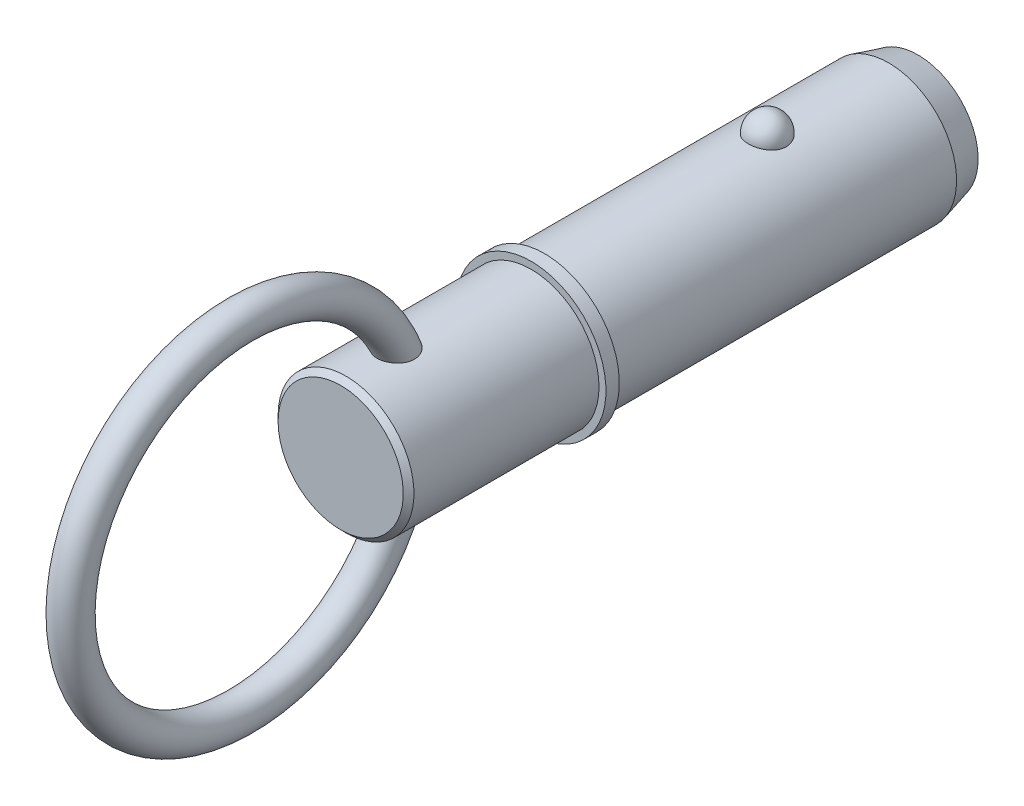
ISO-10303-21;
HEADER;
FILE_DESCRIPTION(('STEP AP214'),'2;1');
FILE_NAME('part.step','',(''),(''),'','','');
FILE_SCHEMA(('AUTOMOTIVE_DESIGN { 1 0 10303 214 1 1 1 1 }'));
ENDSEC;
DATA;
#1=APPLICATION_CONTEXT('core data for automotive mechanical design processes');
#2=APPLICATION_PROTOCOL_DEFINITION('international standard','automotive_design',2000,#1);
#3=PRODUCT_CONTEXT('',#1,'mechanical');
#4=PRODUCT('Part','Part','',(#3));
#5=PRODUCT_RELATED_PRODUCT_CATEGORY('part','',(#4));
#6=PRODUCT_DEFINITION_FORMATION('','',#4);
#7=PRODUCT_DEFINITION_CONTEXT('part definition',#1,'design');
#8=PRODUCT_DEFINITION('design','',#6,#7);
#9=PRODUCT_DEFINITION_SHAPE('','',#8);
#10=(LENGTH_UNIT() NAMED_UNIT(*) SI_UNIT(.MILLI.,.METRE.));
#11=(NAMED_UNIT(*) PLANE_ANGLE_UNIT() SI_UNIT($,.RADIAN.));
#12=(NAMED_UNIT(*) SI_UNIT($,.STERADIAN.) SOLID_ANGLE_UNIT());
#13=UNCERTAINTY_MEASURE_WITH_UNIT(LENGTH_MEASURE(1.E-05),#10,'distance_accuracy_value','');
#14=(GEOMETRIC_REPRESENTATION_CONTEXT(3) GLOBAL_UNCERTAINTY_ASSIGNED_CONTEXT((#13)) GLOBAL_UNIT_ASSIGNED_CONTEXT((#10,
#11,#12)) REPRESENTATION_CONTEXT('',''));
#15=CARTESIAN_POINT('',(0.,0.,0.));
#16=DIRECTION('',(0.,0.,1.));
#17=DIRECTION('',(1.,0.,0.));
#18=AXIS2_PLACEMENT_3D('',#15,#16,#17);
#19=CARTESIAN_POINT('',(0.,0.,38.1));
#20=DIRECTION('',(0.,0.,-1.));
#21=DIRECTION('',(-1.,0.,0.));
#22=AXIS2_PLACEMENT_3D('',#19,#20,#21);
#23=CYLINDRICAL_SURFACE('',#22,12.7);
#24=CARTESIAN_POINT('',(3.52486003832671,12.2010393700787,-3.56));
#25=CARTESIAN_POINT('',(3.52485671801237,12.2010422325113,-3.3610062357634));
#26=CARTESIAN_POINT('',(3.50863187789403,12.2057632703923,-3.16197042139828));
#27=CARTESIAN_POINT('',(3.4441205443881,12.2241207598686,-2.76953945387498));
#28=CARTESIAN_POINT('',(3.39582213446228,12.2377605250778,-2.57614642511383));
#29=CARTESIAN_POINT('',(3.26839193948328,12.2724057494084,-2.20059799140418));
#30=CARTESIAN_POINT('',(3.18927369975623,12.2934079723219,-2.01843769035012));
#31=CARTESIAN_POINT('',(3.00217139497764,12.3404306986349,-1.6703228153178));
#32=CARTESIAN_POINT('',(2.89418796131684,12.3664510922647,-1.50436788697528));
#33=CARTESIAN_POINT('',(2.65144862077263,12.4207616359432,-1.19241975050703));
#34=CARTESIAN_POINT('',(2.51656310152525,12.4490623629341,-1.04652919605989));
#35=CARTESIAN_POINT('',(2.22383249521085,12.5046678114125,-0.779711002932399));
#36=CARTESIAN_POINT('',(2.0659873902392,12.5319725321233,-0.658783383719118));
#37=CARTESIAN_POINT('',(1.73204520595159,12.5824645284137,-0.445586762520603));
#38=CARTESIAN_POINT('',(1.55600183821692,12.6056634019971,-0.353236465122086));
#39=CARTESIAN_POINT('',(1.19021695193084,12.6454411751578,-0.199381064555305));
#40=CARTESIAN_POINT('',(1.00047694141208,12.662020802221,-0.137872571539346));
#41=CARTESIAN_POINT('',(0.616329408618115,12.6864692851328,-0.0483191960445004));
#42=CARTESIAN_POINT('',(0.422067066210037,12.6944893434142,-0.0196927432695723));
#43=CARTESIAN_POINT('',(0.0313259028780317,12.7014637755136,0.00524116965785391));
#44=CARTESIAN_POINT('',(-0.16515270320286,12.7004190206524,0.0015517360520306));
#45=CARTESIAN_POINT('',(-0.55178088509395,12.6894611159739,-0.0377454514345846));
#46=CARTESIAN_POINT('',(-0.741980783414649,12.6796749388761,-0.0728962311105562));
#47=CARTESIAN_POINT('',(-1.11361063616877,12.6524544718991,-0.173489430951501));
#48=CARTESIAN_POINT('',(-1.29504043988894,12.6350200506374,-0.238932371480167));
#49=CARTESIAN_POINT('',(-1.64521311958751,12.5942270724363,-0.398772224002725));
#50=CARTESIAN_POINT('',(-1.81387645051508,12.5708347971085,-0.493334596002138));
#51=CARTESIAN_POINT('',(-2.13292959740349,12.5206522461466,-0.708731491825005));
#52=CARTESIAN_POINT('',(-2.28331755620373,12.4938616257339,-0.829568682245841));
#53=CARTESIAN_POINT('',(-2.56470285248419,12.4391828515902,-1.0968714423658));
#54=CARTESIAN_POINT('',(-2.69527522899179,12.4112835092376,-1.24378221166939));
#55=CARTESIAN_POINT('',(-2.93023079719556,12.3579248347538,-1.55763192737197));
#56=CARTESIAN_POINT('',(-3.03461212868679,12.3324656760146,-1.72457229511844));
#57=CARTESIAN_POINT('',(-3.21564423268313,12.2865167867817,-2.07598316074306));
#58=CARTESIAN_POINT('',(-3.29196222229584,12.2660875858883,-2.26063321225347));
#59=CARTESIAN_POINT('',(-3.41323771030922,12.2328979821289,-2.64061334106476));
#60=CARTESIAN_POINT('',(-3.45819611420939,12.2201373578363,-2.83594310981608));
#61=CARTESIAN_POINT('',(-3.51550038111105,12.2037762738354,-3.2308649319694));
#62=CARTESIAN_POINT('',(-3.5279827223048,12.200137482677,-3.43043558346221));
#63=CARTESIAN_POINT('',(-3.52041430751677,12.2023234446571,-3.8289025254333));
#64=CARTESIAN_POINT('',(-3.50036443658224,12.2081479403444,-4.02779883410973));
#65=CARTESIAN_POINT('',(-3.42842010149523,12.2285446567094,-4.41824213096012));
#66=CARTESIAN_POINT('',(-3.37668525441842,12.243073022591,-4.6098208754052));
#67=CARTESIAN_POINT('',(-3.24279085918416,12.2792134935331,-4.98132360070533));
#68=CARTESIAN_POINT('',(-3.16063009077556,12.300825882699,-5.16124711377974));
#69=CARTESIAN_POINT('',(-2.96738224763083,12.3488691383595,-5.5054285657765));
#70=CARTESIAN_POINT('',(-2.85613997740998,12.3753256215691,-5.66959579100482));
#71=CARTESIAN_POINT('',(-2.60773241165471,12.4300386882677,-5.97665065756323));
#72=CARTESIAN_POINT('',(-2.47056612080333,12.458295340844,-6.11953748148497));
#73=CARTESIAN_POINT('',(-2.17327999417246,12.5135827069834,-6.38059312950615));
#74=CARTESIAN_POINT('',(-2.01307652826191,12.5406084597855,-6.49866785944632));
#75=CARTESIAN_POINT('',(-1.67442544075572,12.5902954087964,-6.70609314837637));
#76=CARTESIAN_POINT('',(-1.49597909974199,12.6129569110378,-6.79544572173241));
#77=CARTESIAN_POINT('',(-1.12819666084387,12.6511224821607,-6.94192787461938));
#78=CARTESIAN_POINT('',(-0.939024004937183,12.666712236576,-6.99944518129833));
#79=CARTESIAN_POINT('',(-0.553267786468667,12.6894125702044,-7.08227444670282));
#80=CARTESIAN_POINT('',(-0.356685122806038,12.6965241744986,-7.10759029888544));
#81=CARTESIAN_POINT('',(0.0343320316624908,12.7014305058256,-7.12510946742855));
#82=CARTESIAN_POINT('',(0.228736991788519,12.6993986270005,-7.11792901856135));
#83=CARTESIAN_POINT('',(0.613493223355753,12.6866339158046,-7.07206766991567));
#84=CARTESIAN_POINT('',(0.80384464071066,12.6759013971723,-7.03338790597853));
#85=CARTESIAN_POINT('',(1.17440741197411,12.6469443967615,-6.925834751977));
#86=CARTESIAN_POINT('',(1.35465462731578,12.6287486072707,-6.85707692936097));
#87=CARTESIAN_POINT('',(1.70092526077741,12.5867908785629,-6.69128257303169));
#88=CARTESIAN_POINT('',(1.86694777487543,12.5630285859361,-6.59424424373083));
#89=CARTESIAN_POINT('',(2.18289085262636,12.5120350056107,-6.3727748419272));
#90=CARTESIAN_POINT('',(2.33252391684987,12.4847559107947,-6.24794475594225));
#91=CARTESIAN_POINT('',(2.60889724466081,12.4299457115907,-5.97511730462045));
#92=CARTESIAN_POINT('',(2.73563353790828,12.4024145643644,-5.82711592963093));
#93=CARTESIAN_POINT('',(2.96505559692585,12.3495984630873,-5.50912267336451));
#94=CARTESIAN_POINT('',(3.06728335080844,12.3243610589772,-5.33879227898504));
#95=CARTESIAN_POINT('',(3.24218794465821,12.2795120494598,-4.98295005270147));
#96=CARTESIAN_POINT('',(3.31487538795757,12.2598984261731,-4.79744369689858));
#97=CARTESIAN_POINT('',(3.42255689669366,12.2302435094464,-4.43775244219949));
#98=CARTESIAN_POINT('',(3.46085292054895,12.2193780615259,-4.264615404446));
#99=CARTESIAN_POINT('',(3.5120056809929,12.2047747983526,-3.9143299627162));
#100=CARTESIAN_POINT('',(3.52486299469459,12.2010368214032,-3.73718164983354));
#101=CARTESIAN_POINT('',(3.52486003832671,12.2010393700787,-3.56));
#102=B_SPLINE_CURVE_WITH_KNOTS('',3,(#24,#25,#26,#27,#28,#29,#30,#31,#32,#33,#34,#35,#36,#37,
#38,#39,#40,#41,#42,#43,#44,#45,#46,#47,#48,#49,#50,#51,#52,#53,#54,#55,#56,#57,#58,#59,#60,#61,
#62,#63,#64,#65,#66,#67,#68,#69,#70,#71,#72,#73,#74,#75,#76,#77,#78,#79,#80,#81,#82,#83,#84,#85,
#86,#87,#88,#89,#90,#91,#92,#93,#94,#95,#96,#97,#98,#99,#100,#101),.UNSPECIFIED.,.T.,.F.,(4,2,2,
2,2,2,2,2,2,2,2,2,2,2,2,2,2,2,2,2,2,2,2,2,2,2,2,2,2,2,2,2,2,2,2,2,2,2,4),(0.,0.596344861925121,
1.19291141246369,1.78921606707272,2.38550767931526,2.98474477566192,3.58398233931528,
4.18149920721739,4.77895038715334,5.36566361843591,5.95232045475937,6.53059198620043,
7.10887345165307,7.6905033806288,8.27219236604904,8.86498552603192,9.45782077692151,
10.0574751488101,10.6571122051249,11.2542252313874,11.8513220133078,12.4454353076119,
13.0395724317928,13.636947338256,14.2343451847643,14.8339691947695,15.4335511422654,
16.0256602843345,16.6176978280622,17.1985559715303,17.7793931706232,18.3580179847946,
18.9366795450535,19.5242567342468,20.1119357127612,20.7098642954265,21.3075780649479,
21.8385683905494,22.3695466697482),.UNSPECIFIED.);
#103=CARTESIAN_POINT('',(3.52486003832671,12.2010393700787,-3.56));
#104=VERTEX_POINT('',#103);
#105=EDGE_CURVE('E102',#104,#104,#102,.T.);
#106=ORIENTED_EDGE('',*,*,#105,.T.);
#107=EDGE_LOOP('',(#106));
#108=FACE_BOUND('',#107,.T.);
#109=CARTESIAN_POINT('',(0.,0.,-26.2500000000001));
#110=DIRECTION('',(0.,0.,-1.));
#111=DIRECTION('',(-1.,0.,0.));
#112=AXIS2_PLACEMENT_3D('',#109,#110,#111);
#113=CIRCLE('',#112,12.7);
#114=CARTESIAN_POINT('',(-12.7,0.,-26.2500000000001));
#115=VERTEX_POINT('',#114);
#116=EDGE_CURVE('E110',#115,#115,#113,.F.);
#117=ORIENTED_EDGE('',*,*,#116,.T.);
#118=EDGE_LOOP('',(#117));
#119=FACE_BOUND('',#118,.T.);
#120=CARTESIAN_POINT('',(0.,0.,38.1));
#121=DIRECTION('',(0.,0.,1.));
#122=DIRECTION('',(1.,0.,0.));
#123=AXIS2_PLACEMENT_3D('',#120,#121,#122);
#124=CIRCLE('',#123,12.7);
#125=CARTESIAN_POINT('',(12.7,0.,38.1));
#126=VERTEX_POINT('',#125);
#127=EDGE_CURVE('E108',#126,#126,#124,.T.);
#128=ORIENTED_EDGE('',*,*,#127,.F.);
#129=EDGE_LOOP('',(#128));
#130=FACE_BOUND('',#129,.T.);
#131=ADVANCED_FACE('F39',(#108,#119,#130),#23,.T.);
#132=CARTESIAN_POINT('',(0.,0.,-31.75));
#133=DIRECTION('',(0.,0.,-1.));
#134=DIRECTION('',(-1.,0.,0.));
#135=AXIS2_PLACEMENT_3D('',#132,#133,#134);
#136=PLANE('',#135);
#137=CARTESIAN_POINT('',(0.,0.,-31.75));
#138=DIRECTION('',(0.,0.,-1.));
#139=DIRECTION('',(-1.,0.,0.));
#140=AXIS2_PLACEMENT_3D('',#137,#138,#139);
#141=CIRCLE('',#140,11.2262794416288);
#142=CARTESIAN_POINT('',(-11.2262794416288,0.,-31.75));
#143=VERTEX_POINT('',#142);
#144=EDGE_CURVE('E143',#143,#143,#141,.T.);
#145=ORIENTED_EDGE('',*,*,#144,.T.);
#146=EDGE_LOOP('',(#145));
#147=FACE_BOUND('',#146,.T.);
#148=ADVANCED_FACE('F88',(#147),#136,.T.);
#149=CARTESIAN_POINT('',(0.,0.,-31.75));
#150=DIRECTION('',(0.,0.,1.));
#151=DIRECTION('',(1.,0.,0.));
#152=AXIS2_PLACEMENT_3D('',#149,#150,#151);
#153=CONICAL_SURFACE('',#152,11.2262794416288,0.26179938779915);
#154=ORIENTED_EDGE('',*,*,#116,.F.);
#155=EDGE_LOOP('',(#154));
#156=FACE_BOUND('',#155,.T.);
#157=ORIENTED_EDGE('',*,*,#144,.F.);
#158=EDGE_LOOP('',(#157));
#159=FACE_BOUND('',#158,.T.);
#160=ADVANCED_FACE('F94',(#156,#159),#153,.T.);
#161=CARTESIAN_POINT('',(0.,12.7,-3.56));
#162=DIRECTION('',(0.,1.,0.));
#163=DIRECTION('',(0.,0.,1.));
#164=AXIS2_PLACEMENT_3D('',#161,#162,#163);
#165=SPHERICAL_SURFACE('',#164,3.56);
#166=ORIENTED_EDGE('',*,*,#105,.F.);
#167=EDGE_LOOP('',(#166));
#168=FACE_BOUND('',#167,.T.);
#169=ADVANCED_FACE('F113',(#168),#165,.T.);
#170=CARTESIAN_POINT('',(0.,0.,38.1));
#171=DIRECTION('',(0.,0.,-1.));
#172=DIRECTION('',(-1.,0.,0.));
#173=AXIS2_PLACEMENT_3D('',#170,#171,#172);
#174=PLANE('',#173);
#175=ORIENTED_EDGE('',*,*,#127,.T.);
#176=EDGE_LOOP('',(#175));
#177=FACE_BOUND('',#176,.T.);
#178=CARTESIAN_POINT('',(0.,0.,38.1));
#179=DIRECTION('',(0.,0.,-1.));
#180=DIRECTION('',(-1.,0.,0.));
#181=AXIS2_PLACEMENT_3D('',#178,#179,#180);
#182=CIRCLE('',#181,14.);
#183=CARTESIAN_POINT('',(-14.,0.,38.1));
#184=VERTEX_POINT('',#183);
#185=EDGE_CURVE('E109',#184,#184,#182,.T.);
#186=ORIENTED_EDGE('',*,*,#185,.T.);
#187=EDGE_LOOP('',(#186));
#188=FACE_BOUND('',#187,.T.);
#189=ADVANCED_FACE('F117',(#177,#188),#174,.T.);
#190=CARTESIAN_POINT('',(0.,0.,33.7287874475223));
#191=DIRECTION('',(0.,0.,-1.));
#192=DIRECTION('',(-1.,0.,0.));
#193=AXIS2_PLACEMENT_3D('',#190,#191,#192);
#194=CYLINDRICAL_SURFACE('',#193,14.);
#195=CARTESIAN_POINT('',(0.,0.,40.6));
#196=DIRECTION('',(0.,0.,-1.));
#197=DIRECTION('',(-1.,0.,0.));
#198=AXIS2_PLACEMENT_3D('',#195,#196,#197);
#199=CIRCLE('',#198,14.);
#200=CARTESIAN_POINT('',(-14.,0.,40.6));
#201=VERTEX_POINT('',#200);
#202=EDGE_CURVE('E134',#201,#201,#199,.T.);
#203=ORIENTED_EDGE('',*,*,#202,.T.);
#204=EDGE_LOOP('',(#203));
#205=FACE_BOUND('',#204,.T.);
#206=ORIENTED_EDGE('',*,*,#185,.F.);
#207=EDGE_LOOP('',(#206));
#208=FACE_BOUND('',#207,.T.);
#209=ADVANCED_FACE('F121',(#205,#208),#194,.T.);
#210=CARTESIAN_POINT('',(0.,14.,40.6));
#211=DIRECTION('',(0.,0.,1.));
#212=DIRECTION('',(1.,0.,0.));
#213=AXIS2_PLACEMENT_3D('',#210,#211,#212);
#214=PLANE('',#213);
#215=CARTESIAN_POINT('',(0.,0.,40.6));
#216=DIRECTION('',(0.,0.,1.));
#217=DIRECTION('',(1.,0.,0.));
#218=AXIS2_PLACEMENT_3D('',#215,#216,#217);
#219=CIRCLE('',#218,12.7);
#220=CARTESIAN_POINT('',(12.7,0.,40.6));
#221=VERTEX_POINT('',#220);
#222=EDGE_CURVE('E112',#221,#221,#219,.T.);
#223=ORIENTED_EDGE('',*,*,#222,.F.);
#224=EDGE_LOOP('',(#223));
#225=FACE_BOUND('',#224,.T.);
#226=ORIENTED_EDGE('',*,*,#202,.F.);
#227=EDGE_LOOP('',(#226));
#228=FACE_BOUND('',#227,.T.);
#229=ADVANCED_FACE('F85',(#225,#228),#214,.T.);
#230=CARTESIAN_POINT('',(0.,0.,76.2));
#231=DIRECTION('',(0.,0.,-1.));
#232=DIRECTION('',(-1.,0.,0.));
#233=AXIS2_PLACEMENT_3D('',#230,#231,#232);
#234=CYLINDRICAL_SURFACE('',#233,12.7);
#235=CARTESIAN_POINT('',(-1.22892607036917,-12.6404011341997,62.5711939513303));
#236=CARTESIAN_POINT('',(-1.0611992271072,-12.6567092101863,62.5040042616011));
#237=CARTESIAN_POINT('',(-0.88766380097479,-12.6701810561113,62.4507925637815));
#238=CARTESIAN_POINT('',(-0.533823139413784,-12.6900116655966,62.3734192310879));
#239=CARTESIAN_POINT('',(-0.353518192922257,-12.6963707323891,62.3492563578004));
#240=CARTESIAN_POINT('',(0.00871153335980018,-12.7012887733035,62.3305190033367));
#241=CARTESIAN_POINT('',(0.190636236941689,-12.699848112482,62.3359431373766));
#242=CARTESIAN_POINT('',(0.550971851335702,-12.6893231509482,62.3762551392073));
#243=CARTESIAN_POINT('',(0.729382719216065,-12.6802387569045,62.4111433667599));
#244=CARTESIAN_POINT('',(1.07771687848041,-12.6553960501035,62.5096598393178));
#245=CARTESIAN_POINT('',(1.24763507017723,-12.6396337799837,62.573305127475));
#246=CARTESIAN_POINT('',(1.57398922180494,-12.6031560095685,62.7278916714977));
#247=CARTESIAN_POINT('',(1.73042571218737,-12.5824407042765,62.8188318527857));
#248=CARTESIAN_POINT('',(2.02464767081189,-12.5384554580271,63.0253206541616));
#249=CARTESIAN_POINT('',(2.16251370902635,-12.5151974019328,63.1407569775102));
#250=CARTESIAN_POINT('',(2.41652917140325,-12.4686447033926,63.3934261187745));
#251=CARTESIAN_POINT('',(2.53268123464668,-12.4453500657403,63.530656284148));
#252=CARTESIAN_POINT('',(2.7397169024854,-12.4014166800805,63.8222617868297));
#253=CARTESIAN_POINT('',(2.83072997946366,-12.3807646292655,63.9765433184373));
#254=CARTESIAN_POINT('',(2.98642630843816,-12.3441356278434,64.298338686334));
#255=CARTESIAN_POINT('',(3.05110876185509,-12.3281588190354,64.4658529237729));
#256=CARTESIAN_POINT('',(3.1545033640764,-12.3021148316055,64.8127059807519));
#257=CARTESIAN_POINT('',(3.19268116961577,-12.2921697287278,64.9922122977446));
#258=CARTESIAN_POINT('',(3.24150148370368,-12.2793848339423,65.3551447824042));
#259=CARTESIAN_POINT('',(3.25213515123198,-12.2765473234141,65.5385721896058));
#260=CARTESIAN_POINT('',(3.24696781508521,-12.2779158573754,65.9188932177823));
#261=CARTESIAN_POINT('',(3.22910261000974,-12.2826719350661,66.1157539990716));
#262=CARTESIAN_POINT('',(3.1650495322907,-12.2993299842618,66.5044791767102));
#263=CARTESIAN_POINT('',(3.11884966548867,-12.3112349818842,66.6963414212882));
#264=CARTESIAN_POINT('',(2.99323123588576,-12.3424162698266,67.0928913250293));
#265=CARTESIAN_POINT('',(2.91059577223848,-12.3623844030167,67.2965057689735));
#266=CARTESIAN_POINT('',(2.71447440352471,-12.4069229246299,67.6881909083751));
#267=CARTESIAN_POINT('',(2.60094970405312,-12.431499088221,67.8762416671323));
#268=CARTESIAN_POINT('',(2.40499526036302,-12.4703951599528,68.1474701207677));
#269=CARTESIAN_POINT('',(2.33301847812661,-12.4841083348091,68.2384072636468));
#270=CARTESIAN_POINT('',(2.18106597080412,-12.5115521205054,68.4133206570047));
#271=CARTESIAN_POINT('',(2.10108885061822,-12.5252827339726,68.4972956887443));
#272=CARTESIAN_POINT('',(1.8497396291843,-12.5657115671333,68.7367795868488));
#273=CARTESIAN_POINT('',(1.6664677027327,-12.5917488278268,68.8805264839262));
#274=CARTESIAN_POINT('',(1.33551340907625,-12.6303067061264,69.0858562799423));
#275=CARTESIAN_POINT('',(1.19512135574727,-12.6444898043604,69.1590224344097));
#276=CARTESIAN_POINT('',(0.903945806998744,-12.6686276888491,69.2815868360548));
#277=CARTESIAN_POINT('',(0.753173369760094,-12.6785868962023,69.3310099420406));
#278=CARTESIAN_POINT('',(0.444090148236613,-12.6931800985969,69.4029423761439));
#279=CARTESIAN_POINT('',(0.285741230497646,-12.6977833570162,69.4252963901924));
#280=CARTESIAN_POINT('',(-0.0324491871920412,-12.700953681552,69.4407247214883));
#281=CARTESIAN_POINT('',(-0.192290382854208,-12.6995219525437,69.4338048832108));
#282=CARTESIAN_POINT('',(-0.493822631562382,-12.6912132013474,69.3932090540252));
#283=CARTESIAN_POINT('',(-0.635865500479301,-12.6848307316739,69.3619622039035));
#284=CARTESIAN_POINT('',(-0.913041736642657,-12.6678986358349,69.2777216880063));
#285=CARTESIAN_POINT('',(-1.04817349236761,-12.6573480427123,69.2247229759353));
#286=CARTESIAN_POINT('',(-1.31637898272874,-12.6323524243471,69.0962339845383));
#287=CARTESIAN_POINT('',(-1.44890088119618,-12.6177203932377,69.0196381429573));
#288=CARTESIAN_POINT('',(-1.70162176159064,-12.5861326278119,68.8487430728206));
#289=CARTESIAN_POINT('',(-1.82181486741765,-12.569175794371,68.7544354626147));
#290=CARTESIAN_POINT('',(-2.06961284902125,-12.5309682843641,68.5326655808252));
#291=CARTESIAN_POINT('',(-2.19457628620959,-12.5094982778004,68.4022933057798));
#292=CARTESIAN_POINT('',(-2.42503767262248,-12.4668738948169,68.1253083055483));
#293=CARTESIAN_POINT('',(-2.53052086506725,-12.4457197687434,67.9786834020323));
#294=CARTESIAN_POINT('',(-2.73961150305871,-12.4015349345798,67.6430656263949));
#295=CARTESIAN_POINT('',(-2.83895917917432,-12.3789253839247,67.4513469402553));
#296=CARTESIAN_POINT('',(-3.00725804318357,-12.3391195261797,67.0544056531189));
#297=CARTESIAN_POINT('',(-3.07618857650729,-12.3219268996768,66.8491739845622));
#298=CARTESIAN_POINT('',(-3.18528660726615,-12.2942052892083,66.4137546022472));
#299=CARTESIAN_POINT('',(-3.22287145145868,-12.2842816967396,66.1828554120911));
#300=CARTESIAN_POINT('',(-3.24821271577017,-12.2775854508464,65.8343510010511));
#301=CARTESIAN_POINT('',(-3.25148236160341,-12.276719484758,65.7177778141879));
#302=CARTESIAN_POINT('',(-3.24729041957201,-12.2778310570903,65.4848590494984));
#303=CARTESIAN_POINT('',(-3.23983534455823,-12.2798068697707,65.368513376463));
#304=CARTESIAN_POINT('',(-3.21488959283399,-12.286359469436,65.1462276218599));
#305=CARTESIAN_POINT('',(-3.19823165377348,-12.2907201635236,65.0401869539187));
#306=CARTESIAN_POINT('',(-3.15537465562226,-12.3017926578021,64.8302225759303));
#307=CARTESIAN_POINT('',(-3.12918076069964,-12.3085031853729,64.7262977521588));
#308=CARTESIAN_POINT('',(-3.06721568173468,-12.3240904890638,64.5215537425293));
#309=CARTESIAN_POINT('',(-3.03144854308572,-12.3329663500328,64.4207332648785));
#310=CARTESIAN_POINT('',(-2.95042598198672,-12.3525998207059,64.2231715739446));
#311=CARTESIAN_POINT('',(-2.90517160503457,-12.3633572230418,64.1264299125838));
#312=CARTESIAN_POINT('',(-2.81116315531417,-12.3850478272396,63.9488579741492));
#313=CARTESIAN_POINT('',(-2.76340897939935,-12.3958187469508,63.8674768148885));
#314=CARTESIAN_POINT('',(-2.66091958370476,-12.4182228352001,63.7093176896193));
#315=CARTESIAN_POINT('',(-2.60618212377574,-12.4298562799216,63.6325412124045));
#316=CARTESIAN_POINT('',(-2.49013138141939,-12.4536239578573,63.4842781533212));
#317=CARTESIAN_POINT('',(-2.42882150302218,-12.4657579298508,63.4127888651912));
#318=CARTESIAN_POINT('',(-2.30002146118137,-12.4901640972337,63.2755874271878));
#319=CARTESIAN_POINT('',(-2.23252894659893,-12.5024363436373,63.2098774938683));
#320=CARTESIAN_POINT('',(-2.09370795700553,-12.5264205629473,63.0863775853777));
#321=CARTESIAN_POINT('',(-2.02252382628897,-12.5381388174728,63.0284267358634));
#322=CARTESIAN_POINT('',(-1.87531735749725,-12.5610012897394,62.91889123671));
#323=CARTESIAN_POINT('',(-1.79929316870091,-12.5721452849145,62.8673090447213));
#324=CARTESIAN_POINT('',(-1.56485282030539,-12.6042047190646,62.7227065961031));
#325=CARTESIAN_POINT('',(-1.39990754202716,-12.6237766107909,62.6396874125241));
#326=CARTESIAN_POINT('',(-1.22892607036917,-12.6404011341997,62.5711939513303));
#327=B_SPLINE_CURVE_WITH_KNOTS('',3,(#235,#236,#237,#238,#239,#240,#241,#242,#243,#244,#245,
#246,#247,#248,#249,#250,#251,#252,#253,#254,#255,#256,#257,#258,#259,#260,#261,#262,#263,#264,
#265,#266,#267,#268,#269,#270,#271,#272,#273,#274,#275,#276,#277,#278,#279,#280,#281,#282,#283,
#284,#285,#286,#287,#288,#289,#290,#291,#292,#293,#294,#295,#296,#297,#298,#299,#300,#301,#302,
#303,#304,#305,#306,#307,#308,#309,#310,#311,#312,#313,#314,#315,#316,#317,#318,#319,#320,#321,
#322,#323,#324,#325,#326),.UNSPECIFIED.,.T.,.F.,(4,2,2,2,2,2,2,2,2,2,2,2,2,2,2,2,2,2,2,2,2,2,2,
2,2,2,2,2,2,2,2,2,2,2,2,2,2,2,2,2,2,2,2,2,2,4),(0.,0.543509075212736,1.08699497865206,
1.63045544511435,2.17392254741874,2.71771216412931,3.26148037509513,3.80280767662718,
4.34406914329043,4.8824886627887,5.42092451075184,5.96992270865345,6.51909710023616,
7.10988630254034,7.70092576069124,8.36013748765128,9.02018098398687,9.37009147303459,
9.72006308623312,10.4175255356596,10.8925536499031,11.3670833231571,11.844322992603,
12.3214673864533,12.7562647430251,13.1911630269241,13.6507378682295,14.110530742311,
14.6541210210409,15.198121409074,15.8467121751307,16.4957426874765,17.1940750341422,
17.5435132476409,17.8927393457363,18.2145822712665,18.536251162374,18.8577843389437,
19.1792821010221,19.4638320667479,19.7484735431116,20.0329683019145,20.3175717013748,
20.5948148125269,20.8721645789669,21.4262200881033),.UNSPECIFIED.);
#328=CARTESIAN_POINT('',(-1.22892607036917,-12.6404011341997,62.5711939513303));
#329=VERTEX_POINT('',#328);
#330=EDGE_CURVE('E10',#329,#329,#327,.T.);
#331=ORIENTED_EDGE('',*,*,#330,.F.);
#332=EDGE_LOOP('',(#331));
#333=FACE_BOUND('',#332,.T.);
#334=CARTESIAN_POINT('',(-1.22892607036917,12.6404011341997,62.5711939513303));
#335=CARTESIAN_POINT('',(-1.39512541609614,12.624240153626,62.63776712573));
#336=CARTESIAN_POINT('',(-1.55582432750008,12.6052778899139,62.7181538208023));
#337=CARTESIAN_POINT('',(-1.86136954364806,12.5638060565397,62.9046587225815));
#338=CARTESIAN_POINT('',(-2.00617769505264,12.5412882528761,63.0108369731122));
#339=CARTESIAN_POINT('',(-2.27547906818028,12.4952333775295,63.2461035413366));
#340=CARTESIAN_POINT('',(-2.39998742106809,12.4716970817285,63.3751746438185));
#341=CARTESIAN_POINT('',(-2.62534229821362,12.4262157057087,63.6526236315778));
#342=CARTESIAN_POINT('',(-2.72620384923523,12.4042696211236,63.8009891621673));
#343=CARTESIAN_POINT('',(-2.90197976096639,12.3643304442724,64.1126750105));
#344=CARTESIAN_POINT('',(-2.97691335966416,12.3463344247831,64.2759841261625));
#345=CARTESIAN_POINT('',(-3.09983588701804,12.3160482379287,64.6129272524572));
#346=CARTESIAN_POINT('',(-3.14781852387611,12.3037594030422,64.786563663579));
#347=CARTESIAN_POINT('',(-3.21809353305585,12.2855709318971,65.1455239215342));
#348=CARTESIAN_POINT('',(-3.23943500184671,12.2799082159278,65.331044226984));
#349=CARTESIAN_POINT('',(-3.2544382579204,12.2759385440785,65.7032324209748));
#350=CARTESIAN_POINT('',(-3.24809142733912,12.2776338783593,65.889900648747));
#351=CARTESIAN_POINT('',(-3.20755159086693,12.288291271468,66.2775770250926));
#352=CARTESIAN_POINT('',(-3.17081691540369,12.2979162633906,66.478299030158));
#353=CARTESIAN_POINT('',(-3.06845850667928,12.3238513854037,66.8718580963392));
#354=CARTESIAN_POINT('',(-3.00281105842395,12.3401670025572,67.0646885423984));
#355=CARTESIAN_POINT('',(-2.83560995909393,12.3797223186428,67.4594732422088));
#356=CARTESIAN_POINT('',(-2.73085133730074,12.4035339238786,67.6600192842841));
#357=CARTESIAN_POINT('',(-2.48976141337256,12.4541651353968,68.0408130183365));
#358=CARTESIAN_POINT('',(-2.35343772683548,12.4809840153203,68.2210655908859));
#359=CARTESIAN_POINT('',(-2.07683984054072,12.5296806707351,68.5256599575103));
#360=CARTESIAN_POINT('',(-1.94129351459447,12.551613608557,68.6542839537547));
#361=CARTESIAN_POINT('',(-1.65081707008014,12.5931023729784,68.8878364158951));
#362=CARTESIAN_POINT('',(-1.49591505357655,12.6126615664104,68.9927986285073));
#363=CARTESIAN_POINT('',(-1.19690065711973,12.6442092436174,69.1577889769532));
#364=CARTESIAN_POINT('',(-1.05541267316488,12.6569190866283,69.2224184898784));
#365=CARTESIAN_POINT('',(-0.763415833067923,12.6778764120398,69.3276387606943));
#366=CARTESIAN_POINT('',(-0.612913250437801,12.6861269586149,69.3682460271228));
#367=CARTESIAN_POINT('',(-0.306168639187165,12.697239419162,69.4227152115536));
#368=CARTESIAN_POINT('',(-0.149903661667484,12.7000767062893,69.4364549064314));
#369=CARTESIAN_POINT('',(0.162552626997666,12.699920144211,69.4356942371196));
#370=CARTESIAN_POINT('',(0.318743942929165,12.6969267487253,69.421196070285));
#371=CARTESIAN_POINT('',(0.614555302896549,12.6859231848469,69.3672341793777));
#372=CARTESIAN_POINT('',(0.754548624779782,12.6782987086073,69.3296876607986));
#373=CARTESIAN_POINT('',(1.02685044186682,12.6591561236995,69.2337115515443));
#374=CARTESIAN_POINT('',(1.15915690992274,12.6476369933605,69.1752764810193));
#375=CARTESIAN_POINT('',(1.42405861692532,12.6206654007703,69.0349885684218));
#376=CARTESIAN_POINT('',(1.55582877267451,12.604971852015,68.9516353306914));
#377=CARTESIAN_POINT('',(1.80621935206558,12.571537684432,68.7674980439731));
#378=CARTESIAN_POINT('',(1.92483289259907,12.5537960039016,68.6667049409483));
#379=CARTESIAN_POINT('',(2.16936918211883,12.5140714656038,68.4301745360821));
#380=CARTESIAN_POINT('',(2.29236422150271,12.4919255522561,68.2914396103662));
#381=CARTESIAN_POINT('',(2.51762485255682,12.4484835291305,67.9979131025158));
#382=CARTESIAN_POINT('',(2.61987416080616,12.4271880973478,67.8431090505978));
#383=CARTESIAN_POINT('',(2.81956306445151,12.3835520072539,67.4913163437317));
#384=CARTESIAN_POINT('',(2.91268031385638,12.3617361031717,67.291798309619));
#385=CARTESIAN_POINT('',(3.06675738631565,12.3244204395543,66.8798981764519));
#386=CARTESIAN_POINT('',(3.12769905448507,12.3089242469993,66.6675088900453));
#387=CARTESIAN_POINT('',(3.19410612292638,12.2917937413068,66.3377293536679));
#388=CARTESIAN_POINT('',(3.21217746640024,12.2870696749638,66.2229179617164));
#389=CARTESIAN_POINT('',(3.23822570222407,12.2802317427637,65.9920954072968));
#390=CARTESIAN_POINT('',(3.24620727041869,12.2781166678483,65.8760848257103));
#391=CARTESIAN_POINT('',(3.25166839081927,12.2766712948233,65.6438104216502));
#392=CARTESIAN_POINT('',(3.24914931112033,12.2773406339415,65.5275466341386));
#393=CARTESIAN_POINT('',(3.23325304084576,12.2815367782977,65.2958693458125));
#394=CARTESIAN_POINT('',(3.2198826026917,12.2850618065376,65.1804553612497));
#395=CARTESIAN_POINT('',(3.18378347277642,12.2944635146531,64.962188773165));
#396=CARTESIAN_POINT('',(3.16203615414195,12.3000921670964,64.8591627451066));
#397=CARTESIAN_POINT('',(3.109310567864,12.3135262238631,64.6556941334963));
#398=CARTESIAN_POINT('',(3.07833729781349,12.3213304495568,64.55525018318));
#399=CARTESIAN_POINT('',(3.00719503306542,12.3388864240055,64.3578823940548));
#400=CARTESIAN_POINT('',(2.9670290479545,12.34863753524,64.2609574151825));
#401=CARTESIAN_POINT('',(2.87766260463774,12.3697681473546,64.0715530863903));
#402=CARTESIAN_POINT('',(2.82846300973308,12.3811474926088,63.979073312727));
#403=CARTESIAN_POINT('',(2.72718770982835,12.4038233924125,63.8092787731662));
#404=CARTESIAN_POINT('',(2.67601025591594,12.4149937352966,63.7314098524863));
#405=CARTESIAN_POINT('',(2.56702778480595,12.4379850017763,63.5805146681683));
#406=CARTESIAN_POINT('',(2.5092205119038,12.4498061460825,63.507490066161));
#407=CARTESIAN_POINT('',(2.38741431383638,12.4737362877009,63.3669157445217));
#408=CARTESIAN_POINT('',(2.32341881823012,12.4858451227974,63.2993630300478));
#409=CARTESIAN_POINT('',(2.18967865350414,12.5099935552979,63.1701830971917));
#410=CARTESIAN_POINT('',(2.11993188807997,12.5220331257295,63.1085580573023));
#411=CARTESIAN_POINT('',(1.90863625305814,12.5565453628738,62.9379714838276));
#412=CARTESIAN_POINT('',(1.75996750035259,12.5784460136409,62.8375080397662));
#413=CARTESIAN_POINT('',(1.44761854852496,12.6182083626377,62.6627484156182));
#414=CARTESIAN_POINT('',(1.28394037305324,12.6360706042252,62.5884487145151));
#415=CARTESIAN_POINT('',(0.945887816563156,12.6658634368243,62.4675372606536));
#416=CARTESIAN_POINT('',(0.771499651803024,12.6777861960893,62.4209620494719));
#417=CARTESIAN_POINT('',(0.417041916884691,12.694390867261,62.3566734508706));
#418=CARTESIAN_POINT('',(0.236969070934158,12.6990685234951,62.3389770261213));
#419=CARTESIAN_POINT('',(-0.124879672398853,12.7006841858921,62.3328291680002));
#420=CARTESIAN_POINT('',(-0.306658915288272,12.6975703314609,62.3445736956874));
#421=CARTESIAN_POINT('',(-0.665297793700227,12.6838264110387,62.3974733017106));
#422=CARTESIAN_POINT('',(-0.842168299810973,12.6732146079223,62.4385569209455));
#423=CARTESIAN_POINT('',(-1.05025519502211,12.6565519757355,62.505394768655));
#424=CARTESIAN_POINT('',(-1.08632235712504,12.6535053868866,62.5176815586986));
#425=CARTESIAN_POINT('',(-1.15798463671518,12.6471484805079,62.5435019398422));
#426=CARTESIAN_POINT('',(-1.19357974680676,12.643838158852,62.5570355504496));
#427=CARTESIAN_POINT('',(-1.22892607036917,12.6404011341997,62.5711939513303));
#428=B_SPLINE_CURVE_WITH_KNOTS('',3,(#334,#335,#336,#337,#338,#339,#340,#341,#342,#343,#344,
#345,#346,#347,#348,#349,#350,#351,#352,#353,#354,#355,#356,#357,#358,#359,#360,#361,#362,#363,
#364,#365,#366,#367,#368,#369,#370,#371,#372,#373,#374,#375,#376,#377,#378,#379,#380,#381,#382,
#383,#384,#385,#386,#387,#388,#389,#390,#391,#392,#393,#394,#395,#396,#397,#398,#399,#400,#401,
#402,#403,#404,#405,#406,#407,#408,#409,#410,#411,#412,#413,#414,#415,#416,#417,#418,#419,#420,
#421,#422,#423,#424,#425,#426,#427),.UNSPECIFIED.,.T.,.F.,(4,2,2,2,2,2,2,2,2,2,2,2,2,2,2,2,2,2,
2,2,2,2,2,2,2,2,2,2,2,2,2,2,2,2,2,2,2,2,2,2,2,2,2,2,2,2,4),(0.,0.539146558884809,
1.07956050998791,1.61956978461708,2.15923496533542,2.69849886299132,3.23788860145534,
3.79602631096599,4.35433775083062,4.96471598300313,5.57559579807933,6.25509482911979,
6.93443009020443,7.49671429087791,8.05819140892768,8.52445959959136,8.99040698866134,
9.45846913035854,9.92649485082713,10.3600530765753,10.7937251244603,11.2621204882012,
11.7307597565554,12.2888675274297,12.8474116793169,13.5084064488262,14.1697737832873,
14.5183408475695,14.8667463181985,15.2151063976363,15.5632498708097,15.8791508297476,
16.1948809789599,16.5105079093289,16.826104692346,17.1072964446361,17.3885841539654,
17.669716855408,17.9509524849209,18.4904482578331,19.0298713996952,19.5700039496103,
20.1104536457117,20.6545101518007,21.1972460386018,21.3119068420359,21.4265694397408),.UNSPECIFIED.);
#429=CARTESIAN_POINT('',(-1.22892607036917,12.6404011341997,62.5711939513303));
#430=VERTEX_POINT('',#429);
#431=EDGE_CURVE('E51',#430,#430,#428,.T.);
#432=ORIENTED_EDGE('',*,*,#431,.F.);
#433=EDGE_LOOP('',(#432));
#434=FACE_BOUND('',#433,.T.);
#435=CARTESIAN_POINT('',(0.,0.,75.1999999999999));
#436=DIRECTION('',(0.,0.,-1.));
#437=DIRECTION('',(-1.,0.,0.));
#438=AXIS2_PLACEMENT_3D('',#435,#436,#437);
#439=CIRCLE('',#438,12.7);
#440=CARTESIAN_POINT('',(-12.7,0.,75.1999999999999));
#441=VERTEX_POINT('',#440);
#442=EDGE_CURVE('E64',#441,#441,#439,.T.);
#443=ORIENTED_EDGE('',*,*,#442,.T.);
#444=EDGE_LOOP('',(#443));
#445=FACE_BOUND('',#444,.T.);
#446=ORIENTED_EDGE('',*,*,#222,.T.);
#447=EDGE_LOOP('',(#446));
#448=FACE_BOUND('',#447,.T.);
#449=ADVANCED_FACE('F69',(#333,#434,#445,#448),#234,.T.);
#450=CARTESIAN_POINT('',(0.,0.,76.2));
#451=DIRECTION('',(0.,0.,-1.));
#452=DIRECTION('',(-1.,0.,0.));
#453=AXIS2_PLACEMENT_3D('',#450,#451,#452);
#454=PLANE('',#453);
#455=CARTESIAN_POINT('',(0.,0.,76.2));
#456=DIRECTION('',(0.,0.,-1.));
#457=DIRECTION('',(-1.,0.,0.));
#458=AXIS2_PLACEMENT_3D('',#455,#456,#457);
#459=CIRCLE('',#458,11.7);
#460=CARTESIAN_POINT('',(-11.7,0.,76.2));
#461=VERTEX_POINT('',#460);
#462=EDGE_CURVE('E58',#461,#461,#459,.F.);
#463=ORIENTED_EDGE('',*,*,#462,.T.);
#464=EDGE_LOOP('',(#463));
#465=FACE_BOUND('',#464,.T.);
#466=ADVANCED_FACE('F76',(#465),#454,.F.);
#467=CARTESIAN_POINT('',(0.,0.,75.1999999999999));
#468=DIRECTION('',(0.,0.,-1.));
#469=DIRECTION('',(-1.,0.,0.));
#470=AXIS2_PLACEMENT_3D('',#467,#468,#469);
#471=CONICAL_SURFACE('',#470,12.7,0.785398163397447);
#472=ORIENTED_EDGE('',*,*,#462,.F.);
#473=EDGE_LOOP('',(#472));
#474=FACE_BOUND('',#473,.T.);
#475=ORIENTED_EDGE('',*,*,#442,.F.);
#476=EDGE_LOOP('',(#475));
#477=FACE_BOUND('',#476,.T.);
#478=ADVANCED_FACE('F41',(#474,#477),#471,.T.);
#479=CARTESIAN_POINT('',(0.,0.,94.95));
#480=DIRECTION('',(1.,0.,0.));
#481=DIRECTION('',(0.,0.,-1.));
#482=AXIS2_PLACEMENT_3D('',#479,#480,#481);
#483=TOROIDAL_SURFACE('',#482,31.75,3.25);
#484=ORIENTED_EDGE('',*,*,#330,.T.);
#485=EDGE_LOOP('',(#484));
#486=FACE_BOUND('',#485,.T.);
#487=ORIENTED_EDGE('',*,*,#431,.T.);
#488=EDGE_LOOP('',(#487));
#489=FACE_BOUND('',#488,.T.);
#490=ADVANCED_FACE('F73',(#486,#489),#483,.T.);
#491=CLOSED_SHELL('',(#131,#148,#160,#169,#189,#209,#229,#449,#466,#478,#490));
#492=MANIFOLD_SOLID_BREP('B2',#491);
#493=ADVANCED_BREP_SHAPE_REPRESENTATION('',(#18,#492),#14);
#494=SHAPE_DEFINITION_REPRESENTATION(#9,#493);
ENDSEC;
END-ISO-10303-21;
